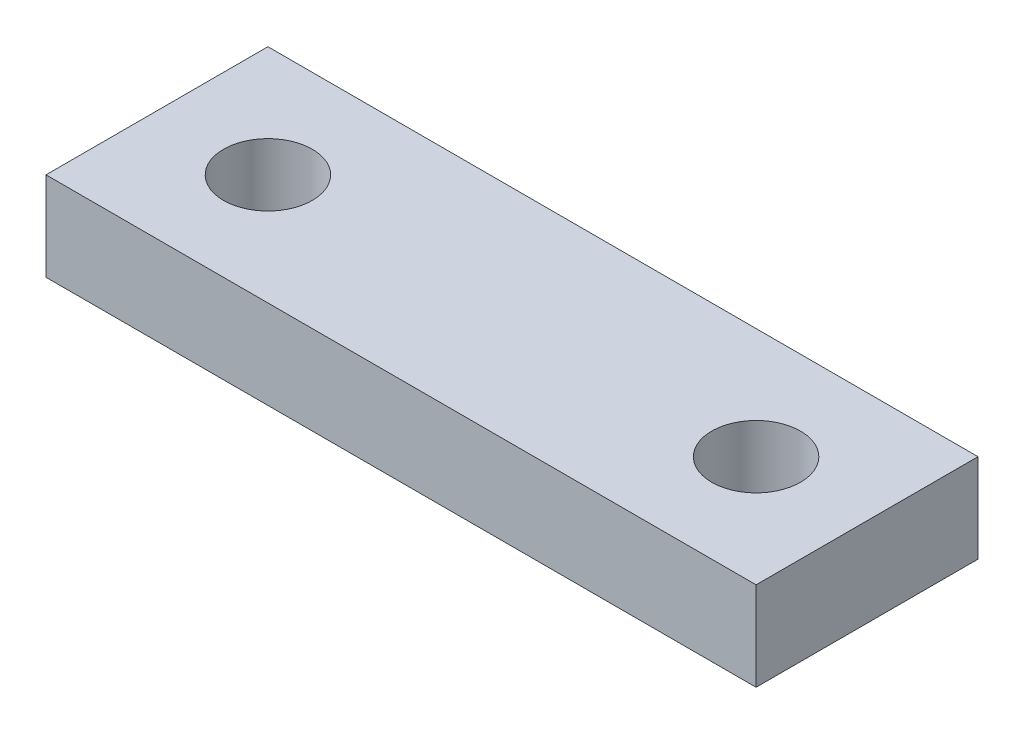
ISO-10303-21;
HEADER;
FILE_DESCRIPTION(('STEP AP214'),'2;1');
FILE_NAME('part.step','',(''),(''),'','','');
FILE_SCHEMA(('AUTOMOTIVE_DESIGN { 1 0 10303 214 1 1 1 1 }'));
ENDSEC;
DATA;
#1=APPLICATION_CONTEXT('core data for automotive mechanical design processes');
#2=APPLICATION_PROTOCOL_DEFINITION('international standard','automotive_design',2000,#1);
#3=PRODUCT_CONTEXT('',#1,'mechanical');
#4=PRODUCT('Part','Part','',(#3));
#5=PRODUCT_RELATED_PRODUCT_CATEGORY('part','',(#4));
#6=PRODUCT_DEFINITION_FORMATION('','',#4);
#7=PRODUCT_DEFINITION_CONTEXT('part definition',#1,'design');
#8=PRODUCT_DEFINITION('design','',#6,#7);
#9=PRODUCT_DEFINITION_SHAPE('','',#8);
#10=(LENGTH_UNIT() NAMED_UNIT(*) SI_UNIT(.MILLI.,.METRE.));
#11=(NAMED_UNIT(*) PLANE_ANGLE_UNIT() SI_UNIT($,.RADIAN.));
#12=(NAMED_UNIT(*) SI_UNIT($,.STERADIAN.) SOLID_ANGLE_UNIT());
#13=UNCERTAINTY_MEASURE_WITH_UNIT(LENGTH_MEASURE(1.E-05),#10,'distance_accuracy_value','');
#14=(GEOMETRIC_REPRESENTATION_CONTEXT(3) GLOBAL_UNCERTAINTY_ASSIGNED_CONTEXT((#13)) GLOBAL_UNIT_ASSIGNED_CONTEXT((#10,
#11,#12)) REPRESENTATION_CONTEXT('',''));
#15=CARTESIAN_POINT('',(0.,0.,0.));
#16=DIRECTION('',(0.,0.,1.));
#17=DIRECTION('',(1.,0.,0.));
#18=AXIS2_PLACEMENT_3D('',#15,#16,#17);
#19=CARTESIAN_POINT('',(0.,3.175,0.));
#20=DIRECTION('',(1.,0.,0.));
#21=DIRECTION('',(0.,0.,-1.));
#22=AXIS2_PLACEMENT_3D('',#19,#20,#21);
#23=PLANE('',#22);
#24=DIRECTION('',(0.,0.,1.));
#25=VECTOR('',#24,1.);
#26=CARTESIAN_POINT('',(0.,0.,0.));
#27=LINE('',#26,#25);
#28=CARTESIAN_POINT('',(0.,0.,-7.9375));
#29=VERTEX_POINT('',#28);
#30=CARTESIAN_POINT('',(0.,0.,0.));
#31=VERTEX_POINT('',#30);
#32=EDGE_CURVE('E95',#29,#31,#27,.T.);
#33=ORIENTED_EDGE('',*,*,#32,.T.);
#34=DIRECTION('',(0.,-1.,0.));
#35=VECTOR('',#34,1.);
#36=CARTESIAN_POINT('',(0.,3.175,0.));
#37=LINE('',#36,#35);
#38=CARTESIAN_POINT('',(0.,3.175,0.));
#39=VERTEX_POINT('',#38);
#40=EDGE_CURVE('E11',#39,#31,#37,.T.);
#41=ORIENTED_EDGE('',*,*,#40,.F.);
#42=DIRECTION('',(0.,0.,1.));
#43=VECTOR('',#42,1.);
#44=CARTESIAN_POINT('',(0.,3.175,0.));
#45=LINE('',#44,#43);
#46=CARTESIAN_POINT('',(0.,3.175,-7.9375));
#47=VERTEX_POINT('',#46);
#48=EDGE_CURVE('E83',#47,#39,#45,.T.);
#49=ORIENTED_EDGE('',*,*,#48,.F.);
#50=DIRECTION('',(0.,-1.,0.));
#51=VECTOR('',#50,1.);
#52=CARTESIAN_POINT('',(0.,3.175,-7.9375));
#53=LINE('',#52,#51);
#54=EDGE_CURVE('E91',#47,#29,#53,.T.);
#55=ORIENTED_EDGE('',*,*,#54,.T.);
#56=EDGE_LOOP('',(#33,#41,#49,#55));
#57=FACE_BOUND('',#56,.T.);
#58=ADVANCED_FACE('F32',(#57),#23,.F.);
#59=CARTESIAN_POINT('',(0.,3.175,0.));
#60=DIRECTION('',(0.,0.,-1.));
#61=DIRECTION('',(-1.,0.,0.));
#62=AXIS2_PLACEMENT_3D('',#59,#60,#61);
#63=PLANE('',#62);
#64=DIRECTION('',(1.,0.,0.));
#65=VECTOR('',#64,1.);
#66=CARTESIAN_POINT('',(0.,0.,0.));
#67=LINE('',#66,#65);
#68=CARTESIAN_POINT('',(25.4,0.,0.));
#69=VERTEX_POINT('',#68);
#70=EDGE_CURVE('E87',#31,#69,#67,.T.);
#71=ORIENTED_EDGE('',*,*,#70,.T.);
#72=DIRECTION('',(0.,-1.,0.));
#73=VECTOR('',#72,1.);
#74=CARTESIAN_POINT('',(25.4,3.175,0.));
#75=LINE('',#74,#73);
#76=CARTESIAN_POINT('',(25.4,3.175,0.));
#77=VERTEX_POINT('',#76);
#78=EDGE_CURVE('E40',#77,#69,#75,.T.);
#79=ORIENTED_EDGE('',*,*,#78,.F.);
#80=DIRECTION('',(1.,0.,0.));
#81=VECTOR('',#80,1.);
#82=CARTESIAN_POINT('',(0.,3.175,0.));
#83=LINE('',#82,#81);
#84=EDGE_CURVE('E78',#39,#77,#83,.T.);
#85=ORIENTED_EDGE('',*,*,#84,.F.);
#86=ORIENTED_EDGE('',*,*,#40,.T.);
#87=EDGE_LOOP('',(#71,#79,#85,#86));
#88=FACE_BOUND('',#87,.T.);
#89=ADVANCED_FACE('F86',(#88),#63,.F.);
#90=CARTESIAN_POINT('',(25.4,3.175,0.));
#91=DIRECTION('',(-1.,0.,0.));
#92=DIRECTION('',(0.,0.,1.));
#93=AXIS2_PLACEMENT_3D('',#90,#91,#92);
#94=PLANE('',#93);
#95=DIRECTION('',(0.,0.,-1.));
#96=VECTOR('',#95,1.);
#97=CARTESIAN_POINT('',(25.4,0.,0.));
#98=LINE('',#97,#96);
#99=CARTESIAN_POINT('',(25.4,0.,-7.9375));
#100=VERTEX_POINT('',#99);
#101=EDGE_CURVE('E65',#69,#100,#98,.T.);
#102=ORIENTED_EDGE('',*,*,#101,.T.);
#103=DIRECTION('',(0.,-1.,0.));
#104=VECTOR('',#103,1.);
#105=CARTESIAN_POINT('',(25.4,3.175,-7.9375));
#106=LINE('',#105,#104);
#107=CARTESIAN_POINT('',(25.4,3.175,-7.9375));
#108=VERTEX_POINT('',#107);
#109=EDGE_CURVE('E88',#108,#100,#106,.T.);
#110=ORIENTED_EDGE('',*,*,#109,.F.);
#111=DIRECTION('',(0.,0.,-1.));
#112=VECTOR('',#111,1.);
#113=CARTESIAN_POINT('',(25.4,3.175,0.));
#114=LINE('',#113,#112);
#115=EDGE_CURVE('E81',#77,#108,#114,.T.);
#116=ORIENTED_EDGE('',*,*,#115,.F.);
#117=ORIENTED_EDGE('',*,*,#78,.T.);
#118=EDGE_LOOP('',(#102,#110,#116,#117));
#119=FACE_BOUND('',#118,.T.);
#120=ADVANCED_FACE('F89',(#119),#94,.F.);
#121=CARTESIAN_POINT('',(0.,3.175,-7.9375));
#122=DIRECTION('',(0.,0.,1.));
#123=DIRECTION('',(1.,0.,0.));
#124=AXIS2_PLACEMENT_3D('',#121,#122,#123);
#125=PLANE('',#124);
#126=DIRECTION('',(-1.,0.,0.));
#127=VECTOR('',#126,1.);
#128=CARTESIAN_POINT('',(0.,0.,-7.9375));
#129=LINE('',#128,#127);
#130=EDGE_CURVE('E71',#100,#29,#129,.T.);
#131=ORIENTED_EDGE('',*,*,#130,.T.);
#132=ORIENTED_EDGE('',*,*,#54,.F.);
#133=DIRECTION('',(-1.,0.,0.));
#134=VECTOR('',#133,1.);
#135=CARTESIAN_POINT('',(0.,3.175,-7.9375));
#136=LINE('',#135,#134);
#137=EDGE_CURVE('E48',#108,#47,#136,.T.);
#138=ORIENTED_EDGE('',*,*,#137,.F.);
#139=ORIENTED_EDGE('',*,*,#109,.T.);
#140=EDGE_LOOP('',(#131,#132,#138,#139));
#141=FACE_BOUND('',#140,.T.);
#142=ADVANCED_FACE('F103',(#141),#125,.F.);
#143=CARTESIAN_POINT('',(0.,3.175,0.));
#144=DIRECTION('',(0.,-1.,0.));
#145=DIRECTION('',(0.,0.,-1.));
#146=AXIS2_PLACEMENT_3D('',#143,#144,#145);
#147=PLANE('',#146);
#148=CARTESIAN_POINT('',(21.43125,3.175,-3.96875000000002));
#149=DIRECTION('',(0.,1.,0.));
#150=DIRECTION('',(0.,0.,1.));
#151=AXIS2_PLACEMENT_3D('',#148,#149,#150);
#152=CIRCLE('',#151,1.5875);
#153=CARTESIAN_POINT('',(21.43125,3.175,-2.38125000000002));
#154=VERTEX_POINT('',#153);
#155=EDGE_CURVE('E115',#154,#154,#152,.T.);
#156=ORIENTED_EDGE('',*,*,#155,.F.);
#157=EDGE_LOOP('',(#156));
#158=FACE_BOUND('',#157,.T.);
#159=CARTESIAN_POINT('',(3.96875,3.175,-3.96875000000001));
#160=DIRECTION('',(0.,1.,0.));
#161=DIRECTION('',(0.,0.,1.));
#162=AXIS2_PLACEMENT_3D('',#159,#160,#161);
#163=CIRCLE('',#162,1.5875);
#164=CARTESIAN_POINT('',(3.96875,3.175,-2.38125000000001));
#165=VERTEX_POINT('',#164);
#166=EDGE_CURVE('E112',#165,#165,#163,.T.);
#167=ORIENTED_EDGE('',*,*,#166,.F.);
#168=EDGE_LOOP('',(#167));
#169=FACE_BOUND('',#168,.T.);
#170=ORIENTED_EDGE('',*,*,#48,.T.);
#171=ORIENTED_EDGE('',*,*,#84,.T.);
#172=ORIENTED_EDGE('',*,*,#115,.T.);
#173=ORIENTED_EDGE('',*,*,#137,.T.);
#174=EDGE_LOOP('',(#170,#171,#172,#173));
#175=FACE_BOUND('',#174,.T.);
#176=ADVANCED_FACE('F79',(#158,#169,#175),#147,.F.);
#177=CARTESIAN_POINT('',(0.,0.,0.));
#178=DIRECTION('',(0.,-1.,0.));
#179=DIRECTION('',(0.,0.,-1.));
#180=AXIS2_PLACEMENT_3D('',#177,#178,#179);
#181=PLANE('',#180);
#182=CARTESIAN_POINT('',(21.43125,0.,-3.96875000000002));
#183=DIRECTION('',(0.,1.,0.));
#184=DIRECTION('',(0.,0.,1.));
#185=AXIS2_PLACEMENT_3D('',#182,#183,#184);
#186=CIRCLE('',#185,1.5875);
#187=CARTESIAN_POINT('',(21.43125,0.,-2.38125000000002));
#188=VERTEX_POINT('',#187);
#189=EDGE_CURVE('E98',#188,#188,#186,.T.);
#190=ORIENTED_EDGE('',*,*,#189,.T.);
#191=EDGE_LOOP('',(#190));
#192=FACE_BOUND('',#191,.T.);
#193=CARTESIAN_POINT('',(3.96875,0.,-3.96875000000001));
#194=DIRECTION('',(0.,1.,0.));
#195=DIRECTION('',(0.,0.,1.));
#196=AXIS2_PLACEMENT_3D('',#193,#194,#195);
#197=CIRCLE('',#196,1.5875);
#198=CARTESIAN_POINT('',(3.96875,0.,-2.38125000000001));
#199=VERTEX_POINT('',#198);
#200=EDGE_CURVE('E109',#199,#199,#197,.T.);
#201=ORIENTED_EDGE('',*,*,#200,.T.);
#202=EDGE_LOOP('',(#201));
#203=FACE_BOUND('',#202,.T.);
#204=ORIENTED_EDGE('',*,*,#32,.F.);
#205=ORIENTED_EDGE('',*,*,#130,.F.);
#206=ORIENTED_EDGE('',*,*,#101,.F.);
#207=ORIENTED_EDGE('',*,*,#70,.F.);
#208=EDGE_LOOP('',(#204,#205,#206,#207));
#209=FACE_BOUND('',#208,.T.);
#210=ADVANCED_FACE('F106',(#192,#203,#209),#181,.T.);
#211=CARTESIAN_POINT('',(3.96875,0.,-3.96875000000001));
#212=DIRECTION('',(0.,1.,0.));
#213=DIRECTION('',(0.,0.,1.));
#214=AXIS2_PLACEMENT_3D('',#211,#212,#213);
#215=CYLINDRICAL_SURFACE('',#214,1.5875);
#216=ORIENTED_EDGE('',*,*,#200,.F.);
#217=EDGE_LOOP('',(#216));
#218=FACE_BOUND('',#217,.T.);
#219=ORIENTED_EDGE('',*,*,#166,.T.);
#220=EDGE_LOOP('',(#219));
#221=FACE_BOUND('',#220,.T.);
#222=ADVANCED_FACE('F126',(#218,#221),#215,.F.);
#223=CARTESIAN_POINT('',(21.43125,0.,-3.96875000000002));
#224=DIRECTION('',(0.,1.,0.));
#225=DIRECTION('',(0.,0.,1.));
#226=AXIS2_PLACEMENT_3D('',#223,#224,#225);
#227=CYLINDRICAL_SURFACE('',#226,1.5875);
#228=ORIENTED_EDGE('',*,*,#189,.F.);
#229=EDGE_LOOP('',(#228));
#230=FACE_BOUND('',#229,.T.);
#231=ORIENTED_EDGE('',*,*,#155,.T.);
#232=EDGE_LOOP('',(#231));
#233=FACE_BOUND('',#232,.T.);
#234=ADVANCED_FACE('F123',(#230,#233),#227,.F.);
#235=CLOSED_SHELL('',(#58,#89,#120,#142,#176,#210,#222,#234));
#236=MANIFOLD_SOLID_BREP('B2',#235);
#237=ADVANCED_BREP_SHAPE_REPRESENTATION('',(#18,#236),#14);
#238=SHAPE_DEFINITION_REPRESENTATION(#9,#237);
ENDSEC;
END-ISO-10303-21;
